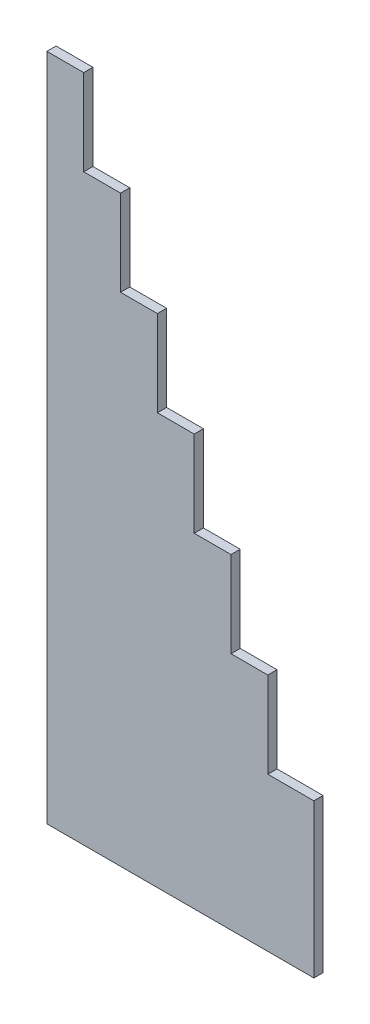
from build123d import *

# Parameters (mm, degrees)
RESSALTO_EXTRUS_O2_DEPTH = 18


with BuildPart() as part:
    # Esbo_o3 → Ressalto-extrus_o2 (new body)
    with BuildSketch(Plane.XY):
        Polygon((0, -118), (0, -1426), (522, -1426), (522, -1126), (432, -1126), (432, -958), (360, -958), (360, -790), (288, -790), (288, -622), (216, -622), (216, -454), (144, -454), (144, -286), (72, -286), (72, -118), align=None)
    extrude(amount=-RESSALTO_EXTRUS_O2_DEPTH)


solid = part.part
